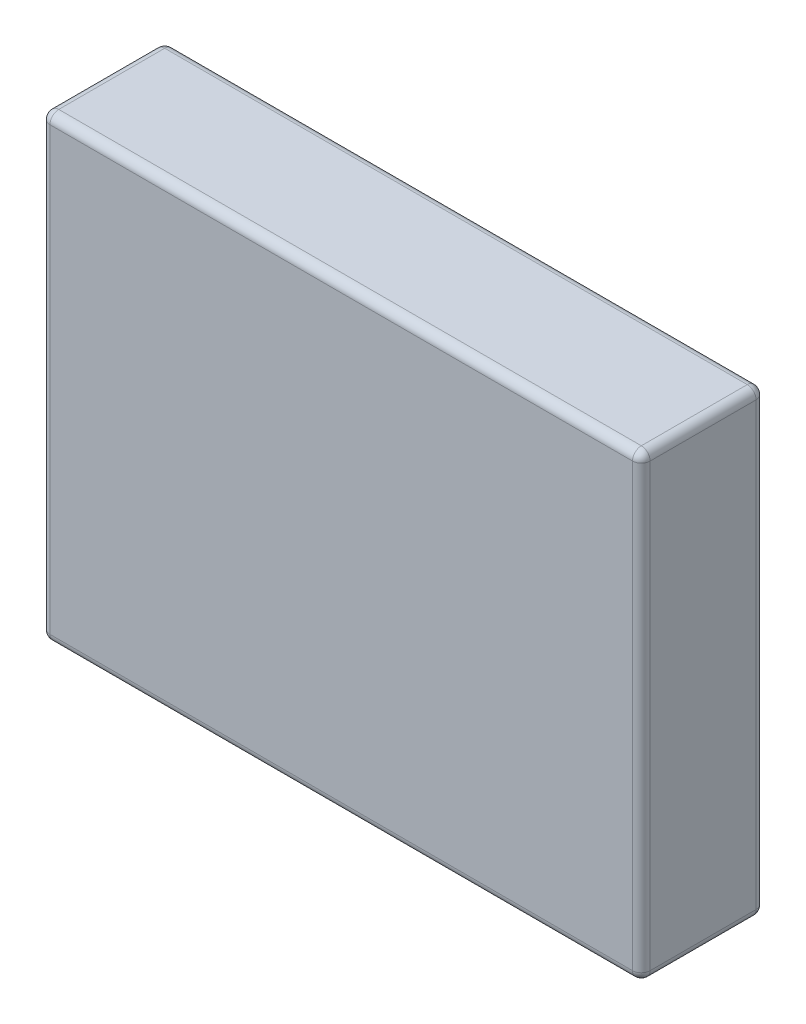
ISO-10303-21;
HEADER;
FILE_DESCRIPTION(('STEP AP214'),'2;1');
FILE_NAME('part.step','',(''),(''),'','','');
FILE_SCHEMA(('AUTOMOTIVE_DESIGN { 1 0 10303 214 1 1 1 1 }'));
ENDSEC;
DATA;
#1=APPLICATION_CONTEXT('core data for automotive mechanical design processes');
#2=APPLICATION_PROTOCOL_DEFINITION('international standard','automotive_design',2000,#1);
#3=PRODUCT_CONTEXT('',#1,'mechanical');
#4=PRODUCT('Part','Part','',(#3));
#5=PRODUCT_RELATED_PRODUCT_CATEGORY('part','',(#4));
#6=PRODUCT_DEFINITION_FORMATION('','',#4);
#7=PRODUCT_DEFINITION_CONTEXT('part definition',#1,'design');
#8=PRODUCT_DEFINITION('design','',#6,#7);
#9=PRODUCT_DEFINITION_SHAPE('','',#8);
#10=(LENGTH_UNIT() NAMED_UNIT(*) SI_UNIT(.MILLI.,.METRE.));
#11=(NAMED_UNIT(*) PLANE_ANGLE_UNIT() SI_UNIT($,.RADIAN.));
#12=(NAMED_UNIT(*) SI_UNIT($,.STERADIAN.) SOLID_ANGLE_UNIT());
#13=UNCERTAINTY_MEASURE_WITH_UNIT(LENGTH_MEASURE(1.E-05),#10,'distance_accuracy_value','');
#14=(GEOMETRIC_REPRESENTATION_CONTEXT(3) GLOBAL_UNCERTAINTY_ASSIGNED_CONTEXT((#13)) GLOBAL_UNIT_ASSIGNED_CONTEXT((#10,
#11,#12)) REPRESENTATION_CONTEXT('',''));
#15=CARTESIAN_POINT('',(0.,0.,0.));
#16=DIRECTION('',(0.,0.,1.));
#17=DIRECTION('',(1.,0.,0.));
#18=AXIS2_PLACEMENT_3D('',#15,#16,#17);
#19=CARTESIAN_POINT('',(0.,0.,70.));
#20=DIRECTION('',(1.,0.,0.));
#21=DIRECTION('',(0.,1.,0.));
#22=AXIS2_PLACEMENT_3D('',#19,#20,#21);
#23=PLANE('',#22);
#24=DIRECTION('',(0.,0.,-1.));
#25=VECTOR('',#24,1.);
#26=CARTESIAN_POINT('',(0.,-5.,70.));
#27=LINE('',#26,#25);
#28=CARTESIAN_POINT('',(0.,-5.,65.));
#29=VERTEX_POINT('',#28);
#30=CARTESIAN_POINT('',(0.,-5.,5.));
#31=VERTEX_POINT('',#30);
#32=EDGE_CURVE('E190',#29,#31,#27,.T.);
#33=ORIENTED_EDGE('',*,*,#32,.T.);
#34=DIRECTION('',(0.,-1.,0.));
#35=VECTOR('',#34,1.);
#36=CARTESIAN_POINT('',(8.60422844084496E-13,0.,5.));
#37=LINE('',#36,#35);
#38=CARTESIAN_POINT('',(0.,-255.,5.));
#39=VERTEX_POINT('',#38);
#40=EDGE_CURVE('E192',#31,#39,#37,.T.);
#41=ORIENTED_EDGE('',*,*,#40,.T.);
#42=DIRECTION('',(0.,0.,-1.));
#43=VECTOR('',#42,1.);
#44=CARTESIAN_POINT('',(0.,-255.,70.));
#45=LINE('',#44,#43);
#46=CARTESIAN_POINT('',(0.,-255.,65.));
#47=VERTEX_POINT('',#46);
#48=EDGE_CURVE('E186',#39,#47,#45,.F.);
#49=ORIENTED_EDGE('',*,*,#48,.T.);
#50=DIRECTION('',(0.,-1.,0.));
#51=VECTOR('',#50,1.);
#52=CARTESIAN_POINT('',(0.,0.,65.));
#53=LINE('',#52,#51);
#54=EDGE_CURVE('E188',#47,#29,#53,.F.);
#55=ORIENTED_EDGE('',*,*,#54,.T.);
#56=EDGE_LOOP('',(#33,#41,#49,#55));
#57=FACE_BOUND('',#56,.T.);
#58=ADVANCED_FACE('F31',(#57),#23,.F.);
#59=CARTESIAN_POINT('',(-8.18789480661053E-13,-260.,70.));
#60=DIRECTION('',(0.,1.,0.));
#61=DIRECTION('',(0.,0.,1.));
#62=AXIS2_PLACEMENT_3D('',#59,#60,#61);
#63=PLANE('',#62);
#64=DIRECTION('',(0.,0.,-1.));
#65=VECTOR('',#64,1.);
#66=CARTESIAN_POINT('',(4.99999999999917,-259.999999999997,70.));
#67=LINE('',#66,#65);
#68=CARTESIAN_POINT('',(5.00000000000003,-259.999999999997,65.));
#69=VERTEX_POINT('',#68);
#70=CARTESIAN_POINT('',(5.00000000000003,-259.999999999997,5.));
#71=VERTEX_POINT('',#70);
#72=EDGE_CURVE('E120',#69,#71,#67,.T.);
#73=ORIENTED_EDGE('',*,*,#72,.T.);
#74=DIRECTION('',(1.,0.,0.));
#75=VECTOR('',#74,1.);
#76=CARTESIAN_POINT('',(0.,-260.,5.));
#77=LINE('',#76,#75);
#78=CARTESIAN_POINT('',(335.,-260.,4.99999999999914));
#79=VERTEX_POINT('',#78);
#80=EDGE_CURVE('E157',#71,#79,#77,.T.);
#81=ORIENTED_EDGE('',*,*,#80,.T.);
#82=DIRECTION('',(0.,0.,-1.));
#83=VECTOR('',#82,1.);
#84=CARTESIAN_POINT('',(335.,-260.,69.9999999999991));
#85=LINE('',#84,#83);
#86=CARTESIAN_POINT('',(335.,-260.,64.9999999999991));
#87=VERTEX_POINT('',#86);
#88=EDGE_CURVE('E123',#79,#87,#85,.F.);
#89=ORIENTED_EDGE('',*,*,#88,.T.);
#90=DIRECTION('',(1.,0.,0.));
#91=VECTOR('',#90,1.);
#92=CARTESIAN_POINT('',(0.,-260.,65.));
#93=LINE('',#92,#91);
#94=EDGE_CURVE('E115',#87,#69,#93,.F.);
#95=ORIENTED_EDGE('',*,*,#94,.T.);
#96=EDGE_LOOP('',(#73,#81,#89,#95));
#97=FACE_BOUND('',#96,.T.);
#98=ADVANCED_FACE('F117',(#97),#63,.F.);
#99=CARTESIAN_POINT('',(339.999999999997,0.,70.));
#100=DIRECTION('',(-1.,0.,0.));
#101=DIRECTION('',(0.,-1.,0.));
#102=AXIS2_PLACEMENT_3D('',#99,#100,#101);
#103=PLANE('',#102);
#104=DIRECTION('',(0.,0.,-1.));
#105=VECTOR('',#104,1.);
#106=CARTESIAN_POINT('',(339.999999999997,-254.999999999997,70.));
#107=LINE('',#106,#105);
#108=CARTESIAN_POINT('',(340.,-254.999999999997,65.));
#109=VERTEX_POINT('',#108);
#110=CARTESIAN_POINT('',(340.,-254.999999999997,5.));
#111=VERTEX_POINT('',#110);
#112=EDGE_CURVE('E168',#109,#111,#107,.T.);
#113=ORIENTED_EDGE('',*,*,#112,.T.);
#114=DIRECTION('',(0.,1.,0.));
#115=VECTOR('',#114,1.);
#116=CARTESIAN_POINT('',(340.,0.,5.));
#117=LINE('',#116,#115);
#118=CARTESIAN_POINT('',(340.,-5.,4.99999999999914));
#119=VERTEX_POINT('',#118);
#120=EDGE_CURVE('E174',#111,#119,#117,.T.);
#121=ORIENTED_EDGE('',*,*,#120,.T.);
#122=DIRECTION('',(0.,0.,-1.));
#123=VECTOR('',#122,1.);
#124=CARTESIAN_POINT('',(340.,-5.,69.9999999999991));
#125=LINE('',#124,#123);
#126=CARTESIAN_POINT('',(340.,-5.,65.));
#127=VERTEX_POINT('',#126);
#128=EDGE_CURVE('E172',#119,#127,#125,.F.);
#129=ORIENTED_EDGE('',*,*,#128,.T.);
#130=DIRECTION('',(0.,1.,0.));
#131=VECTOR('',#130,1.);
#132=CARTESIAN_POINT('',(340.,-259.999999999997,65.));
#133=LINE('',#132,#131);
#134=EDGE_CURVE('E170',#127,#109,#133,.F.);
#135=ORIENTED_EDGE('',*,*,#134,.T.);
#136=EDGE_LOOP('',(#113,#121,#129,#135));
#137=FACE_BOUND('',#136,.T.);
#138=ADVANCED_FACE('F317',(#137),#103,.F.);
#139=CARTESIAN_POINT('',(0.,0.,70.));
#140=DIRECTION('',(0.,-1.,0.));
#141=DIRECTION('',(0.,0.,-1.));
#142=AXIS2_PLACEMENT_3D('',#139,#140,#141);
#143=PLANE('',#142);
#144=DIRECTION('',(0.,0.,-1.));
#145=VECTOR('',#144,1.);
#146=CARTESIAN_POINT('',(334.999999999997,0.,70.));
#147=LINE('',#146,#145);
#148=CARTESIAN_POINT('',(335.,0.,65.));
#149=VERTEX_POINT('',#148);
#150=CARTESIAN_POINT('',(335.,0.,5.));
#151=VERTEX_POINT('',#150);
#152=EDGE_CURVE('E181',#149,#151,#147,.T.);
#153=ORIENTED_EDGE('',*,*,#152,.T.);
#154=DIRECTION('',(-1.,0.,0.));
#155=VECTOR('',#154,1.);
#156=CARTESIAN_POINT('',(8.60422844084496E-13,0.,5.));
#157=LINE('',#156,#155);
#158=CARTESIAN_POINT('',(5.00000000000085,0.,4.99999999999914));
#159=VERTEX_POINT('',#158);
#160=EDGE_CURVE('E183',#151,#159,#157,.T.);
#161=ORIENTED_EDGE('',*,*,#160,.T.);
#162=DIRECTION('',(0.,0.,-1.));
#163=VECTOR('',#162,1.);
#164=CARTESIAN_POINT('',(5.,0.,69.9999999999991));
#165=LINE('',#164,#163);
#166=CARTESIAN_POINT('',(5.,0.,64.9999999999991));
#167=VERTEX_POINT('',#166);
#168=EDGE_CURVE('E177',#159,#167,#165,.F.);
#169=ORIENTED_EDGE('',*,*,#168,.T.);
#170=DIRECTION('',(-1.,0.,0.));
#171=VECTOR('',#170,1.);
#172=CARTESIAN_POINT('',(340.,0.,65.));
#173=LINE('',#172,#171);
#174=EDGE_CURVE('E179',#167,#149,#173,.F.);
#175=ORIENTED_EDGE('',*,*,#174,.T.);
#176=EDGE_LOOP('',(#153,#161,#169,#175));
#177=FACE_BOUND('',#176,.T.);
#178=ADVANCED_FACE('F220',(#177),#143,.F.);
#179=CARTESIAN_POINT('',(-8.18789480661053E-13,-260.,70.));
#180=DIRECTION('',(0.,0.,1.));
#181=DIRECTION('',(1.,0.,0.));
#182=AXIS2_PLACEMENT_3D('',#179,#180,#181);
#183=PLANE('',#182);
#184=DIRECTION('',(0.,1.,0.));
#185=VECTOR('',#184,1.);
#186=CARTESIAN_POINT('',(334.999999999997,0.,70.));
#187=LINE('',#186,#185);
#188=CARTESIAN_POINT('',(334.999999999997,-255.,69.9999999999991));
#189=VERTEX_POINT('',#188);
#190=CARTESIAN_POINT('',(335.,-5.,70.));
#191=VERTEX_POINT('',#190);
#192=EDGE_CURVE('E38',#189,#191,#187,.T.);
#193=ORIENTED_EDGE('',*,*,#192,.T.);
#194=DIRECTION('',(-1.,0.,0.));
#195=VECTOR('',#194,1.);
#196=CARTESIAN_POINT('',(0.,-5.,70.));
#197=LINE('',#196,#195);
#198=CARTESIAN_POINT('',(4.99999999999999,-5.,69.9999999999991));
#199=VERTEX_POINT('',#198);
#200=EDGE_CURVE('E11',#191,#199,#197,.T.);
#201=ORIENTED_EDGE('',*,*,#200,.T.);
#202=DIRECTION('',(0.,-1.,0.));
#203=VECTOR('',#202,1.);
#204=CARTESIAN_POINT('',(4.99999999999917,-259.999999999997,70.));
#205=LINE('',#204,#203);
#206=CARTESIAN_POINT('',(5.00000000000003,-254.999999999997,70.));
#207=VERTEX_POINT('',#206);
#208=EDGE_CURVE('E195',#199,#207,#205,.T.);
#209=ORIENTED_EDGE('',*,*,#208,.T.);
#210=DIRECTION('',(1.,0.,0.));
#211=VECTOR('',#210,1.);
#212=CARTESIAN_POINT('',(339.999999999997,-254.999999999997,70.));
#213=LINE('',#212,#211);
#214=EDGE_CURVE('E48',#207,#189,#213,.T.);
#215=ORIENTED_EDGE('',*,*,#214,.T.);
#216=EDGE_LOOP('',(#193,#201,#209,#215));
#217=FACE_BOUND('',#216,.T.);
#218=ADVANCED_FACE('F197',(#217),#183,.T.);
#219=CARTESIAN_POINT('',(-8.18789480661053E-13,-260.,0.));
#220=DIRECTION('',(0.,0.,1.));
#221=DIRECTION('',(1.,0.,0.));
#222=AXIS2_PLACEMENT_3D('',#219,#220,#221);
#223=PLANE('',#222);
#224=DIRECTION('',(0.,1.,0.));
#225=VECTOR('',#224,1.);
#226=CARTESIAN_POINT('',(335.,-260.,-8.60422844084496E-13));
#227=LINE('',#226,#225);
#228=CARTESIAN_POINT('',(335.,-5.,0.));
#229=VERTEX_POINT('',#228);
#230=CARTESIAN_POINT('',(335.,-255.,-8.60422844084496E-13));
#231=VERTEX_POINT('',#230);
#232=EDGE_CURVE('E163',#229,#231,#227,.F.);
#233=ORIENTED_EDGE('',*,*,#232,.T.);
#234=DIRECTION('',(1.,0.,0.));
#235=VECTOR('',#234,1.);
#236=CARTESIAN_POINT('',(0.,-255.,0.));
#237=LINE('',#236,#235);
#238=CARTESIAN_POINT('',(5.00000000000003,-254.999999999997,0.));
#239=VERTEX_POINT('',#238);
#240=EDGE_CURVE('E165',#231,#239,#237,.F.);
#241=ORIENTED_EDGE('',*,*,#240,.T.);
#242=DIRECTION('',(0.,-1.,0.));
#243=VECTOR('',#242,1.);
#244=CARTESIAN_POINT('',(4.99999999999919,-259.999999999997,0.));
#245=LINE('',#244,#243);
#246=CARTESIAN_POINT('',(4.99999999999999,-5.,-8.60422844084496E-13));
#247=VERTEX_POINT('',#246);
#248=EDGE_CURVE('E159',#239,#247,#245,.F.);
#249=ORIENTED_EDGE('',*,*,#248,.T.);
#250=DIRECTION('',(-1.,0.,0.));
#251=VECTOR('',#250,1.);
#252=CARTESIAN_POINT('',(0.,-5.,0.));
#253=LINE('',#252,#251);
#254=EDGE_CURVE('E161',#247,#229,#253,.F.);
#255=ORIENTED_EDGE('',*,*,#254,.T.);
#256=EDGE_LOOP('',(#233,#241,#249,#255));
#257=FACE_BOUND('',#256,.T.);
#258=ADVANCED_FACE('F328',(#257),#223,.F.);
#259=CARTESIAN_POINT('',(0.,-5.,65.));
#260=DIRECTION('',(1.,0.,0.));
#261=DIRECTION('',(0.,0.,-1.));
#262=AXIS2_PLACEMENT_3D('',#259,#260,#261);
#263=CYLINDRICAL_SURFACE('',#262,5.);
#264=CARTESIAN_POINT('',(5.,-5.,64.9999999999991));
#265=DIRECTION('',(-1.,0.,0.));
#266=DIRECTION('',(0.,0.,1.));
#267=AXIS2_PLACEMENT_3D('',#264,#265,#266);
#268=CIRCLE('',#267,5.);
#269=EDGE_CURVE('E149',#199,#167,#268,.T.);
#270=ORIENTED_EDGE('',*,*,#269,.F.);
#271=ORIENTED_EDGE('',*,*,#200,.F.);
#272=CARTESIAN_POINT('',(335.,-5.,65.));
#273=DIRECTION('',(1.,0.,0.));
#274=DIRECTION('',(0.,0.,-1.));
#275=AXIS2_PLACEMENT_3D('',#272,#273,#274);
#276=CIRCLE('',#275,5.);
#277=EDGE_CURVE('E152',#149,#191,#276,.T.);
#278=ORIENTED_EDGE('',*,*,#277,.F.);
#279=ORIENTED_EDGE('',*,*,#174,.F.);
#280=EDGE_LOOP('',(#270,#271,#278,#279));
#281=FACE_BOUND('',#280,.T.);
#282=ADVANCED_FACE('F215',(#281),#263,.T.);
#283=CARTESIAN_POINT('',(5.,-5.,64.9999999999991));
#284=DIRECTION('',(0.,0.,1.));
#285=DIRECTION('',(1.,0.,0.));
#286=AXIS2_PLACEMENT_3D('',#283,#284,#285);
#287=SPHERICAL_SURFACE('',#286,5.);
#288=CARTESIAN_POINT('',(5.,-5.,64.9999999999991));
#289=DIRECTION('',(0.,1.,0.));
#290=DIRECTION('',(0.,0.,1.));
#291=AXIS2_PLACEMENT_3D('',#288,#289,#290);
#292=CIRCLE('',#291,5.);
#293=EDGE_CURVE('E203',#199,#29,#292,.F.);
#294=ORIENTED_EDGE('',*,*,#293,.F.);
#295=ORIENTED_EDGE('',*,*,#269,.T.);
#296=CARTESIAN_POINT('',(5.,-5.,64.9999999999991));
#297=DIRECTION('',(0.,0.,1.));
#298=DIRECTION('',(1.,0.,0.));
#299=AXIS2_PLACEMENT_3D('',#296,#297,#298);
#300=CIRCLE('',#299,5.);
#301=EDGE_CURVE('E209',#29,#167,#300,.F.);
#302=ORIENTED_EDGE('',*,*,#301,.F.);
#303=EDGE_LOOP('',(#294,#295,#302));
#304=FACE_BOUND('',#303,.T.);
#305=ADVANCED_FACE('F207',(#304),#287,.T.);
#306=CARTESIAN_POINT('',(335.,-5.,65.));
#307=DIRECTION('',(0.,0.,1.));
#308=DIRECTION('',(1.,0.,0.));
#309=AXIS2_PLACEMENT_3D('',#306,#307,#308);
#310=SPHERICAL_SURFACE('',#309,5.);
#311=CARTESIAN_POINT('',(335.,-5.,65.));
#312=DIRECTION('',(0.,0.,1.));
#313=DIRECTION('',(1.,0.,0.));
#314=AXIS2_PLACEMENT_3D('',#311,#312,#313);
#315=CIRCLE('',#314,5.);
#316=EDGE_CURVE('E233',#149,#127,#315,.F.);
#317=ORIENTED_EDGE('',*,*,#316,.F.);
#318=ORIENTED_EDGE('',*,*,#277,.T.);
#319=CARTESIAN_POINT('',(335.,-5.,65.));
#320=DIRECTION('',(0.,1.,0.));
#321=DIRECTION('',(-1.,0.,0.));
#322=AXIS2_PLACEMENT_3D('',#319,#320,#321);
#323=CIRCLE('',#322,5.);
#324=EDGE_CURVE('E211',#127,#191,#323,.F.);
#325=ORIENTED_EDGE('',*,*,#324,.F.);
#326=EDGE_LOOP('',(#317,#318,#325));
#327=FACE_BOUND('',#326,.T.);
#328=ADVANCED_FACE('F291',(#327),#310,.T.);
#329=CARTESIAN_POINT('',(4.99999999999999,-5.,69.9999999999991));
#330=DIRECTION('',(0.,0.,-1.));
#331=DIRECTION('',(-1.,0.,0.));
#332=AXIS2_PLACEMENT_3D('',#329,#330,#331);
#333=CYLINDRICAL_SURFACE('',#332,5.);
#334=ORIENTED_EDGE('',*,*,#301,.T.);
#335=ORIENTED_EDGE('',*,*,#168,.F.);
#336=CARTESIAN_POINT('',(5.,-5.,4.99999999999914));
#337=DIRECTION('',(0.,0.,-1.));
#338=DIRECTION('',(-1.,0.,0.));
#339=AXIS2_PLACEMENT_3D('',#336,#337,#338);
#340=CIRCLE('',#339,5.);
#341=EDGE_CURVE('E227',#31,#159,#340,.T.);
#342=ORIENTED_EDGE('',*,*,#341,.F.);
#343=ORIENTED_EDGE('',*,*,#32,.F.);
#344=EDGE_LOOP('',(#334,#335,#342,#343));
#345=FACE_BOUND('',#344,.T.);
#346=ADVANCED_FACE('F226',(#345),#333,.T.);
#347=CARTESIAN_POINT('',(5.00000000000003,-259.999999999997,65.));
#348=DIRECTION('',(0.,1.,0.));
#349=DIRECTION('',(-1.,0.,0.));
#350=AXIS2_PLACEMENT_3D('',#347,#348,#349);
#351=CYLINDRICAL_SURFACE('',#350,5.);
#352=ORIENTED_EDGE('',*,*,#293,.T.);
#353=ORIENTED_EDGE('',*,*,#54,.F.);
#354=CARTESIAN_POINT('',(5.00000000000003,-254.999999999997,65.));
#355=DIRECTION('',(0.,-1.,0.));
#356=DIRECTION('',(0.,0.,-1.));
#357=AXIS2_PLACEMENT_3D('',#354,#355,#356);
#358=CIRCLE('',#357,5.);
#359=EDGE_CURVE('E135',#207,#47,#358,.T.);
#360=ORIENTED_EDGE('',*,*,#359,.F.);
#361=ORIENTED_EDGE('',*,*,#208,.F.);
#362=EDGE_LOOP('',(#352,#353,#360,#361));
#363=FACE_BOUND('',#362,.T.);
#364=ADVANCED_FACE('F201',(#363),#351,.T.);
#365=CARTESIAN_POINT('',(0.,-255.,65.));
#366=DIRECTION('',(-1.,0.,0.));
#367=DIRECTION('',(0.,0.,1.));
#368=AXIS2_PLACEMENT_3D('',#365,#366,#367);
#369=CYLINDRICAL_SURFACE('',#368,5.);
#370=CARTESIAN_POINT('',(335.,-255.,64.9999999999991));
#371=DIRECTION('',(1.,0.,0.));
#372=DIRECTION('',(0.,0.,-1.));
#373=AXIS2_PLACEMENT_3D('',#370,#371,#372);
#374=CIRCLE('',#373,5.);
#375=EDGE_CURVE('E136',#189,#87,#374,.T.);
#376=ORIENTED_EDGE('',*,*,#375,.F.);
#377=ORIENTED_EDGE('',*,*,#214,.F.);
#378=CARTESIAN_POINT('',(5.00000000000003,-254.999999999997,65.));
#379=DIRECTION('',(-1.,0.,0.));
#380=DIRECTION('',(0.,0.,1.));
#381=AXIS2_PLACEMENT_3D('',#378,#379,#380);
#382=CIRCLE('',#381,5.);
#383=EDGE_CURVE('E129',#69,#207,#382,.T.);
#384=ORIENTED_EDGE('',*,*,#383,.F.);
#385=ORIENTED_EDGE('',*,*,#94,.F.);
#386=EDGE_LOOP('',(#376,#377,#384,#385));
#387=FACE_BOUND('',#386,.T.);
#388=ADVANCED_FACE('F131',(#387),#369,.T.);
#389=CARTESIAN_POINT('',(335.,-260.,64.9999999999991));
#390=DIRECTION('',(0.,-1.,0.));
#391=DIRECTION('',(1.,0.,0.));
#392=AXIS2_PLACEMENT_3D('',#389,#390,#391);
#393=CYLINDRICAL_SURFACE('',#392,5.);
#394=ORIENTED_EDGE('',*,*,#324,.T.);
#395=ORIENTED_EDGE('',*,*,#192,.F.);
#396=CARTESIAN_POINT('',(335.,-255.,64.9999999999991));
#397=DIRECTION('',(0.,-1.,0.));
#398=DIRECTION('',(0.,0.,-1.));
#399=AXIS2_PLACEMENT_3D('',#396,#397,#398);
#400=CIRCLE('',#399,5.);
#401=EDGE_CURVE('E242',#109,#189,#400,.T.);
#402=ORIENTED_EDGE('',*,*,#401,.F.);
#403=ORIENTED_EDGE('',*,*,#134,.F.);
#404=EDGE_LOOP('',(#394,#395,#402,#403));
#405=FACE_BOUND('',#404,.T.);
#406=ADVANCED_FACE('F288',(#405),#393,.T.);
#407=CARTESIAN_POINT('',(335.,-5.,70.));
#408=DIRECTION('',(0.,0.,-1.));
#409=DIRECTION('',(-1.,0.,0.));
#410=AXIS2_PLACEMENT_3D('',#407,#408,#409);
#411=CYLINDRICAL_SURFACE('',#410,5.);
#412=ORIENTED_EDGE('',*,*,#316,.T.);
#413=ORIENTED_EDGE('',*,*,#128,.F.);
#414=CARTESIAN_POINT('',(335.,-5.,5.));
#415=DIRECTION('',(0.,0.,-1.));
#416=DIRECTION('',(-1.,0.,0.));
#417=AXIS2_PLACEMENT_3D('',#414,#415,#416);
#418=CIRCLE('',#417,5.);
#419=EDGE_CURVE('E245',#151,#119,#418,.T.);
#420=ORIENTED_EDGE('',*,*,#419,.F.);
#421=ORIENTED_EDGE('',*,*,#152,.F.);
#422=EDGE_LOOP('',(#412,#413,#420,#421));
#423=FACE_BOUND('',#422,.T.);
#424=ADVANCED_FACE('F295',(#423),#411,.T.);
#425=CARTESIAN_POINT('',(0.,-5.,5.));
#426=DIRECTION('',(-1.,0.,0.));
#427=DIRECTION('',(0.,0.,1.));
#428=AXIS2_PLACEMENT_3D('',#425,#426,#427);
#429=CYLINDRICAL_SURFACE('',#428,5.);
#430=CARTESIAN_POINT('',(5.,-5.,4.99999999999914));
#431=DIRECTION('',(-1.,0.,0.));
#432=DIRECTION('',(0.,0.,1.));
#433=AXIS2_PLACEMENT_3D('',#430,#431,#432);
#434=CIRCLE('',#433,5.);
#435=EDGE_CURVE('E236',#159,#247,#434,.T.);
#436=ORIENTED_EDGE('',*,*,#435,.F.);
#437=ORIENTED_EDGE('',*,*,#160,.F.);
#438=CARTESIAN_POINT('',(335.,-5.,5.));
#439=DIRECTION('',(1.,0.,0.));
#440=DIRECTION('',(0.,0.,-1.));
#441=AXIS2_PLACEMENT_3D('',#438,#439,#440);
#442=CIRCLE('',#441,5.);
#443=EDGE_CURVE('E248',#229,#151,#442,.T.);
#444=ORIENTED_EDGE('',*,*,#443,.F.);
#445=ORIENTED_EDGE('',*,*,#254,.F.);
#446=EDGE_LOOP('',(#436,#437,#444,#445));
#447=FACE_BOUND('',#446,.T.);
#448=ADVANCED_FACE('F304',(#447),#429,.T.);
#449=CARTESIAN_POINT('',(5.,-5.,4.99999999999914));
#450=DIRECTION('',(0.,0.,1.));
#451=DIRECTION('',(1.,0.,0.));
#452=AXIS2_PLACEMENT_3D('',#449,#450,#451);
#453=SPHERICAL_SURFACE('',#452,5.);
#454=ORIENTED_EDGE('',*,*,#341,.T.);
#455=ORIENTED_EDGE('',*,*,#435,.T.);
#456=CARTESIAN_POINT('',(5.,-5.,4.99999999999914));
#457=DIRECTION('',(0.,1.,0.));
#458=DIRECTION('',(-1.,0.,0.));
#459=AXIS2_PLACEMENT_3D('',#456,#457,#458);
#460=CIRCLE('',#459,5.);
#461=EDGE_CURVE('E143',#31,#247,#460,.F.);
#462=ORIENTED_EDGE('',*,*,#461,.F.);
#463=EDGE_LOOP('',(#454,#455,#462));
#464=FACE_BOUND('',#463,.T.);
#465=ADVANCED_FACE('F306',(#464),#453,.T.);
#466=CARTESIAN_POINT('',(5.00000000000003,-254.999999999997,65.));
#467=DIRECTION('',(0.,0.,1.));
#468=DIRECTION('',(1.,0.,0.));
#469=AXIS2_PLACEMENT_3D('',#466,#467,#468);
#470=SPHERICAL_SURFACE('',#469,5.);
#471=ORIENTED_EDGE('',*,*,#383,.T.);
#472=ORIENTED_EDGE('',*,*,#359,.T.);
#473=CARTESIAN_POINT('',(5.00000000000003,-254.999999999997,65.));
#474=DIRECTION('',(0.,0.,1.));
#475=DIRECTION('',(1.,0.,0.));
#476=AXIS2_PLACEMENT_3D('',#473,#474,#475);
#477=CIRCLE('',#476,5.);
#478=EDGE_CURVE('E139',#69,#47,#477,.F.);
#479=ORIENTED_EDGE('',*,*,#478,.F.);
#480=EDGE_LOOP('',(#471,#472,#479));
#481=FACE_BOUND('',#480,.T.);
#482=ADVANCED_FACE('F140',(#481),#470,.T.);
#483=CARTESIAN_POINT('',(335.,-255.,64.9999999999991));
#484=DIRECTION('',(0.,0.,1.));
#485=DIRECTION('',(1.,0.,0.));
#486=AXIS2_PLACEMENT_3D('',#483,#484,#485);
#487=SPHERICAL_SURFACE('',#486,5.);
#488=ORIENTED_EDGE('',*,*,#401,.T.);
#489=ORIENTED_EDGE('',*,*,#375,.T.);
#490=CARTESIAN_POINT('',(335.,-255.,64.9999999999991));
#491=DIRECTION('',(0.,0.,1.));
#492=DIRECTION('',(1.,0.,0.));
#493=AXIS2_PLACEMENT_3D('',#490,#491,#492);
#494=CIRCLE('',#493,5.);
#495=EDGE_CURVE('E144',#109,#87,#494,.F.);
#496=ORIENTED_EDGE('',*,*,#495,.F.);
#497=EDGE_LOOP('',(#488,#489,#496));
#498=FACE_BOUND('',#497,.T.);
#499=ADVANCED_FACE('F284',(#498),#487,.T.);
#500=CARTESIAN_POINT('',(335.,-5.,5.));
#501=DIRECTION('',(0.,0.,1.));
#502=DIRECTION('',(1.,0.,0.));
#503=AXIS2_PLACEMENT_3D('',#500,#501,#502);
#504=SPHERICAL_SURFACE('',#503,5.);
#505=ORIENTED_EDGE('',*,*,#443,.T.);
#506=ORIENTED_EDGE('',*,*,#419,.T.);
#507=CARTESIAN_POINT('',(335.,-5.,5.));
#508=DIRECTION('',(0.,1.,0.));
#509=DIRECTION('',(-1.,0.,0.));
#510=AXIS2_PLACEMENT_3D('',#507,#508,#509);
#511=CIRCLE('',#510,5.);
#512=EDGE_CURVE('E255',#229,#119,#511,.F.);
#513=ORIENTED_EDGE('',*,*,#512,.F.);
#514=EDGE_LOOP('',(#505,#506,#513));
#515=FACE_BOUND('',#514,.T.);
#516=ADVANCED_FACE('F299',(#515),#504,.T.);
#517=CARTESIAN_POINT('',(5.00000000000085,0.,4.99999999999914));
#518=DIRECTION('',(0.,-1.,0.));
#519=DIRECTION('',(1.,0.,0.));
#520=AXIS2_PLACEMENT_3D('',#517,#518,#519);
#521=CYLINDRICAL_SURFACE('',#520,5.);
#522=ORIENTED_EDGE('',*,*,#461,.T.);
#523=ORIENTED_EDGE('',*,*,#248,.F.);
#524=CARTESIAN_POINT('',(5.00000000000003,-254.999999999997,5.));
#525=DIRECTION('',(0.,-1.,0.));
#526=DIRECTION('',(0.,0.,-1.));
#527=AXIS2_PLACEMENT_3D('',#524,#525,#526);
#528=CIRCLE('',#527,5.);
#529=EDGE_CURVE('E257',#39,#239,#528,.T.);
#530=ORIENTED_EDGE('',*,*,#529,.F.);
#531=ORIENTED_EDGE('',*,*,#40,.F.);
#532=EDGE_LOOP('',(#522,#523,#530,#531));
#533=FACE_BOUND('',#532,.T.);
#534=ADVANCED_FACE('F310',(#533),#521,.T.);
#535=CARTESIAN_POINT('',(5.00000000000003,-254.999999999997,70.));
#536=DIRECTION('',(0.,0.,-1.));
#537=DIRECTION('',(-1.,0.,0.));
#538=AXIS2_PLACEMENT_3D('',#535,#536,#537);
#539=CYLINDRICAL_SURFACE('',#538,5.);
#540=ORIENTED_EDGE('',*,*,#478,.T.);
#541=ORIENTED_EDGE('',*,*,#48,.F.);
#542=CARTESIAN_POINT('',(5.00000000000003,-254.999999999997,5.));
#543=DIRECTION('',(0.,0.,-1.));
#544=DIRECTION('',(-1.,0.,0.));
#545=AXIS2_PLACEMENT_3D('',#542,#543,#544);
#546=CIRCLE('',#545,5.);
#547=EDGE_CURVE('E147',#71,#39,#546,.T.);
#548=ORIENTED_EDGE('',*,*,#547,.F.);
#549=ORIENTED_EDGE('',*,*,#72,.F.);
#550=EDGE_LOOP('',(#540,#541,#548,#549));
#551=FACE_BOUND('',#550,.T.);
#552=ADVANCED_FACE('F146',(#551),#539,.T.);
#553=CARTESIAN_POINT('',(334.999999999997,-255.,69.9999999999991));
#554=DIRECTION('',(0.,0.,-1.));
#555=DIRECTION('',(-1.,0.,0.));
#556=AXIS2_PLACEMENT_3D('',#553,#554,#555);
#557=CYLINDRICAL_SURFACE('',#556,5.);
#558=ORIENTED_EDGE('',*,*,#495,.T.);
#559=ORIENTED_EDGE('',*,*,#88,.F.);
#560=CARTESIAN_POINT('',(335.,-255.,4.99999999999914));
#561=DIRECTION('',(0.,0.,-1.));
#562=DIRECTION('',(-1.,0.,0.));
#563=AXIS2_PLACEMENT_3D('',#560,#561,#562);
#564=CIRCLE('',#563,5.);
#565=EDGE_CURVE('E261',#111,#79,#564,.T.);
#566=ORIENTED_EDGE('',*,*,#565,.F.);
#567=ORIENTED_EDGE('',*,*,#112,.F.);
#568=EDGE_LOOP('',(#558,#559,#566,#567));
#569=FACE_BOUND('',#568,.T.);
#570=ADVANCED_FACE('F281',(#569),#557,.T.);
#571=CARTESIAN_POINT('',(335.,0.,5.));
#572=DIRECTION('',(0.,1.,0.));
#573=DIRECTION('',(-1.,0.,0.));
#574=AXIS2_PLACEMENT_3D('',#571,#572,#573);
#575=CYLINDRICAL_SURFACE('',#574,5.);
#576=ORIENTED_EDGE('',*,*,#512,.T.);
#577=ORIENTED_EDGE('',*,*,#120,.F.);
#578=CARTESIAN_POINT('',(335.,-255.,4.99999999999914));
#579=DIRECTION('',(0.,-1.,0.));
#580=DIRECTION('',(0.,0.,-1.));
#581=AXIS2_PLACEMENT_3D('',#578,#579,#580);
#582=CIRCLE('',#581,5.);
#583=EDGE_CURVE('E264',#231,#111,#582,.T.);
#584=ORIENTED_EDGE('',*,*,#583,.F.);
#585=ORIENTED_EDGE('',*,*,#232,.F.);
#586=EDGE_LOOP('',(#576,#577,#584,#585));
#587=FACE_BOUND('',#586,.T.);
#588=ADVANCED_FACE('F364',(#587),#575,.T.);
#589=CARTESIAN_POINT('',(5.00000000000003,-254.999999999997,5.));
#590=DIRECTION('',(0.,0.,1.));
#591=DIRECTION('',(1.,0.,0.));
#592=AXIS2_PLACEMENT_3D('',#589,#590,#591);
#593=SPHERICAL_SURFACE('',#592,5.);
#594=ORIENTED_EDGE('',*,*,#547,.T.);
#595=ORIENTED_EDGE('',*,*,#529,.T.);
#596=CARTESIAN_POINT('',(5.00000000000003,-254.999999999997,5.));
#597=DIRECTION('',(-1.,0.,0.));
#598=DIRECTION('',(0.,0.,1.));
#599=AXIS2_PLACEMENT_3D('',#596,#597,#598);
#600=CIRCLE('',#599,5.);
#601=EDGE_CURVE('E267',#71,#239,#600,.F.);
#602=ORIENTED_EDGE('',*,*,#601,.F.);
#603=EDGE_LOOP('',(#594,#595,#602));
#604=FACE_BOUND('',#603,.T.);
#605=ADVANCED_FACE('F367',(#604),#593,.T.);
#606=CARTESIAN_POINT('',(335.,-255.,4.99999999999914));
#607=DIRECTION('',(0.,0.,1.));
#608=DIRECTION('',(1.,0.,0.));
#609=AXIS2_PLACEMENT_3D('',#606,#607,#608);
#610=SPHERICAL_SURFACE('',#609,5.);
#611=ORIENTED_EDGE('',*,*,#583,.T.);
#612=ORIENTED_EDGE('',*,*,#565,.T.);
#613=CARTESIAN_POINT('',(335.,-255.,4.99999999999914));
#614=DIRECTION('',(1.,0.,0.));
#615=DIRECTION('',(0.,0.,-1.));
#616=AXIS2_PLACEMENT_3D('',#613,#614,#615);
#617=CIRCLE('',#616,5.);
#618=EDGE_CURVE('E269',#231,#79,#617,.F.);
#619=ORIENTED_EDGE('',*,*,#618,.F.);
#620=EDGE_LOOP('',(#611,#612,#619));
#621=FACE_BOUND('',#620,.T.);
#622=ADVANCED_FACE('F277',(#621),#610,.T.);
#623=CARTESIAN_POINT('',(0.,-255.,5.));
#624=DIRECTION('',(1.,0.,0.));
#625=DIRECTION('',(0.,0.,-1.));
#626=AXIS2_PLACEMENT_3D('',#623,#624,#625);
#627=CYLINDRICAL_SURFACE('',#626,5.);
#628=ORIENTED_EDGE('',*,*,#601,.T.);
#629=ORIENTED_EDGE('',*,*,#240,.F.);
#630=ORIENTED_EDGE('',*,*,#618,.T.);
#631=ORIENTED_EDGE('',*,*,#80,.F.);
#632=EDGE_LOOP('',(#628,#629,#630,#631));
#633=FACE_BOUND('',#632,.T.);
#634=ADVANCED_FACE('F274',(#633),#627,.T.);
#635=CLOSED_SHELL('',(#58,#98,#138,#178,#218,#258,#282,#305,#328,#346,#364,#388,#406,#424,#448,
#465,#482,#499,#516,#534,#552,#570,#588,#605,#622,#634));
#636=MANIFOLD_SOLID_BREP('B2',#635);
#637=ADVANCED_BREP_SHAPE_REPRESENTATION('',(#18,#636),#14);
#638=SHAPE_DEFINITION_REPRESENTATION(#9,#637);
ENDSEC;
END-ISO-10303-21;
